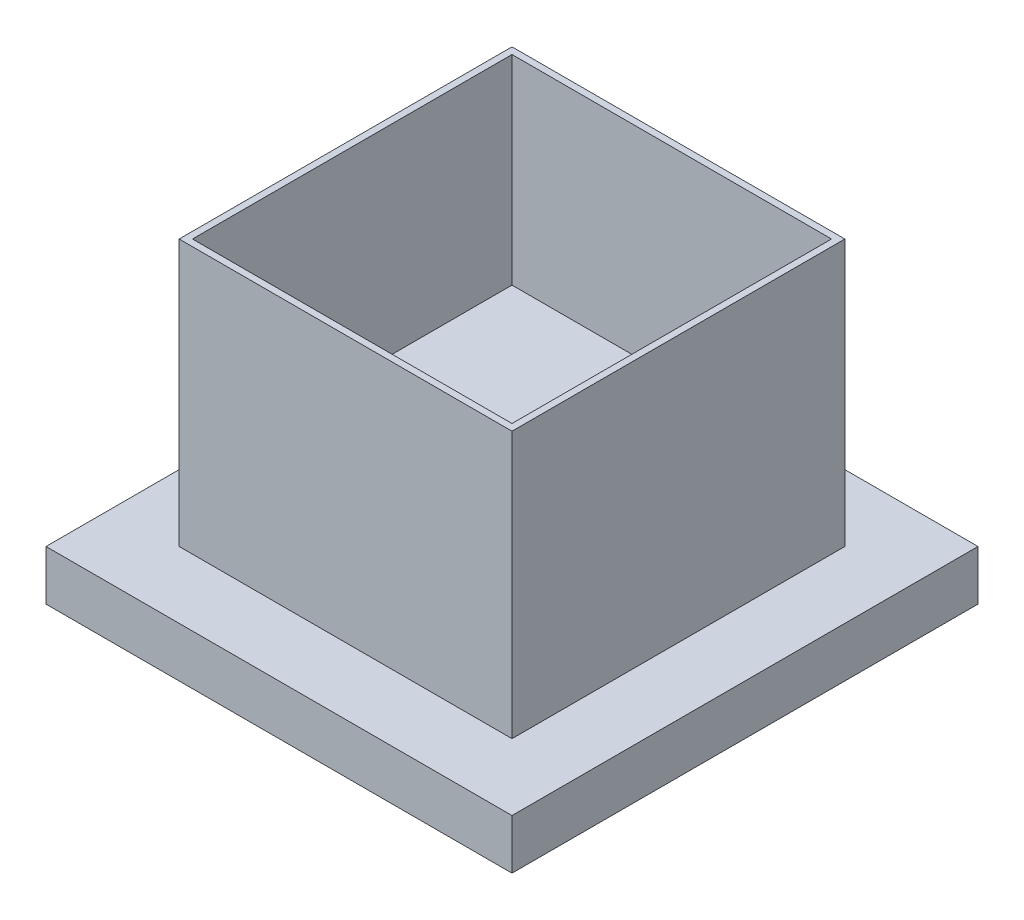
ISO-10303-21;
HEADER;
FILE_DESCRIPTION(('STEP AP214'),'2;1');
FILE_NAME('part.step','',(''),(''),'','','');
FILE_SCHEMA(('AUTOMOTIVE_DESIGN { 1 0 10303 214 1 1 1 1 }'));
ENDSEC;
DATA;
#1=APPLICATION_CONTEXT('core data for automotive mechanical design processes');
#2=APPLICATION_PROTOCOL_DEFINITION('international standard','automotive_design',2000,#1);
#3=PRODUCT_CONTEXT('',#1,'mechanical');
#4=PRODUCT('Part','Part','',(#3));
#5=PRODUCT_RELATED_PRODUCT_CATEGORY('part','',(#4));
#6=PRODUCT_DEFINITION_FORMATION('','',#4);
#7=PRODUCT_DEFINITION_CONTEXT('part definition',#1,'design');
#8=PRODUCT_DEFINITION('design','',#6,#7);
#9=PRODUCT_DEFINITION_SHAPE('','',#8);
#10=(LENGTH_UNIT() NAMED_UNIT(*) SI_UNIT(.MILLI.,.METRE.));
#11=(NAMED_UNIT(*) PLANE_ANGLE_UNIT() SI_UNIT($,.RADIAN.));
#12=(NAMED_UNIT(*) SI_UNIT($,.STERADIAN.) SOLID_ANGLE_UNIT());
#13=UNCERTAINTY_MEASURE_WITH_UNIT(LENGTH_MEASURE(1.E-05),#10,'distance_accuracy_value','');
#14=(GEOMETRIC_REPRESENTATION_CONTEXT(3) GLOBAL_UNCERTAINTY_ASSIGNED_CONTEXT((#13)) GLOBAL_UNIT_ASSIGNED_CONTEXT((#10,
#11,#12)) REPRESENTATION_CONTEXT('',''));
#15=CARTESIAN_POINT('',(0.,0.,0.));
#16=DIRECTION('',(0.,0.,1.));
#17=DIRECTION('',(1.,0.,0.));
#18=AXIS2_PLACEMENT_3D('',#15,#16,#17);
#19=CARTESIAN_POINT('',(0.,7.5,0.));
#20=DIRECTION('',(0.,-1.,0.));
#21=DIRECTION('',(0.,0.,-1.));
#22=AXIS2_PLACEMENT_3D('',#19,#20,#21);
#23=PLANE('',#22);
#24=DIRECTION('',(0.,0.,1.));
#25=VECTOR('',#24,1.);
#26=CARTESIAN_POINT('',(0.,7.5,0.));
#27=LINE('',#26,#25);
#28=CARTESIAN_POINT('',(0.,7.5,-70.));
#29=VERTEX_POINT('',#28);
#30=CARTESIAN_POINT('',(0.,7.5,0.));
#31=VERTEX_POINT('',#30);
#32=EDGE_CURVE('E288',#29,#31,#27,.T.);
#33=ORIENTED_EDGE('',*,*,#32,.T.);
#34=DIRECTION('',(1.,0.,0.));
#35=VECTOR('',#34,1.);
#36=CARTESIAN_POINT('',(0.,7.5,0.));
#37=LINE('',#36,#35);
#38=CARTESIAN_POINT('',(70.,7.5,0.));
#39=VERTEX_POINT('',#38);
#40=EDGE_CURVE('E388',#31,#39,#37,.T.);
#41=ORIENTED_EDGE('',*,*,#40,.T.);
#42=DIRECTION('',(0.,0.,-1.));
#43=VECTOR('',#42,1.);
#44=CARTESIAN_POINT('',(70.,7.5,0.));
#45=LINE('',#44,#43);
#46=CARTESIAN_POINT('',(70.,7.5,-70.));
#47=VERTEX_POINT('',#46);
#48=EDGE_CURVE('E279',#39,#47,#45,.T.);
#49=ORIENTED_EDGE('',*,*,#48,.T.);
#50=DIRECTION('',(-1.,0.,0.));
#51=VECTOR('',#50,1.);
#52=CARTESIAN_POINT('',(0.,7.5,-70.));
#53=LINE('',#52,#51);
#54=EDGE_CURVE('E296',#47,#29,#53,.T.);
#55=ORIENTED_EDGE('',*,*,#54,.T.);
#56=EDGE_LOOP('',(#33,#41,#49,#55));
#57=FACE_BOUND('',#56,.T.);
#58=DIRECTION('',(-1.,0.,0.));
#59=VECTOR('',#58,1.);
#60=CARTESIAN_POINT('',(60.,7.5,-60.));
#61=LINE('',#60,#59);
#62=CARTESIAN_POINT('',(60.,7.5,-60.));
#63=VERTEX_POINT('',#62);
#64=CARTESIAN_POINT('',(10.,7.5,-60.));
#65=VERTEX_POINT('',#64);
#66=EDGE_CURVE('E331',#63,#65,#61,.T.);
#67=ORIENTED_EDGE('',*,*,#66,.F.);
#68=DIRECTION('',(0.,0.,-1.));
#69=VECTOR('',#68,1.);
#70=CARTESIAN_POINT('',(60.,7.5,-10.));
#71=LINE('',#70,#69);
#72=CARTESIAN_POINT('',(60.,7.5,-10.));
#73=VERTEX_POINT('',#72);
#74=EDGE_CURVE('E346',#73,#63,#71,.T.);
#75=ORIENTED_EDGE('',*,*,#74,.F.);
#76=DIRECTION('',(1.,0.,0.));
#77=VECTOR('',#76,1.);
#78=CARTESIAN_POINT('',(10.,7.5,-10.));
#79=LINE('',#78,#77);
#80=CARTESIAN_POINT('',(10.,7.5,-10.));
#81=VERTEX_POINT('',#80);
#82=EDGE_CURVE('E363',#81,#73,#79,.T.);
#83=ORIENTED_EDGE('',*,*,#82,.F.);
#84=DIRECTION('',(0.,0.,1.));
#85=VECTOR('',#84,1.);
#86=CARTESIAN_POINT('',(10.,7.5,-60.));
#87=LINE('',#86,#85);
#88=EDGE_CURVE('E359',#65,#81,#87,.T.);
#89=ORIENTED_EDGE('',*,*,#88,.F.);
#90=EDGE_LOOP('',(#67,#75,#83,#89));
#91=FACE_BOUND('',#90,.T.);
#92=ADVANCED_FACE('F41',(#57,#91),#23,.F.);
#93=CARTESIAN_POINT('',(0.,7.5,0.));
#94=DIRECTION('',(1.,0.,0.));
#95=DIRECTION('',(0.,0.,-1.));
#96=AXIS2_PLACEMENT_3D('',#93,#94,#95);
#97=PLANE('',#96);
#98=DIRECTION('',(0.,0.,1.));
#99=VECTOR('',#98,1.);
#100=CARTESIAN_POINT('',(0.,0.,0.));
#101=LINE('',#100,#99);
#102=CARTESIAN_POINT('',(0.,0.,-70.));
#103=VERTEX_POINT('',#102);
#104=CARTESIAN_POINT('',(0.,0.,0.));
#105=VERTEX_POINT('',#104);
#106=EDGE_CURVE('E275',#103,#105,#101,.T.);
#107=ORIENTED_EDGE('',*,*,#106,.T.);
#108=DIRECTION('',(0.,-1.,0.));
#109=VECTOR('',#108,1.);
#110=CARTESIAN_POINT('',(0.,7.5,0.));
#111=LINE('',#110,#109);
#112=EDGE_CURVE('E269',#31,#105,#111,.T.);
#113=ORIENTED_EDGE('',*,*,#112,.F.);
#114=ORIENTED_EDGE('',*,*,#32,.F.);
#115=DIRECTION('',(0.,-1.,0.));
#116=VECTOR('',#115,1.);
#117=CARTESIAN_POINT('',(0.,7.5,-70.));
#118=LINE('',#117,#116);
#119=EDGE_CURVE('E292',#29,#103,#118,.T.);
#120=ORIENTED_EDGE('',*,*,#119,.T.);
#121=EDGE_LOOP('',(#107,#113,#114,#120));
#122=FACE_BOUND('',#121,.T.);
#123=ADVANCED_FACE('F43',(#122),#97,.F.);
#124=CARTESIAN_POINT('',(0.,7.5,0.));
#125=DIRECTION('',(0.,0.,-1.));
#126=DIRECTION('',(-1.,0.,0.));
#127=AXIS2_PLACEMENT_3D('',#124,#125,#126);
#128=PLANE('',#127);
#129=DIRECTION('',(1.,0.,0.));
#130=VECTOR('',#129,1.);
#131=CARTESIAN_POINT('',(0.,0.,0.));
#132=LINE('',#131,#130);
#133=CARTESIAN_POINT('',(70.,0.,0.));
#134=VERTEX_POINT('',#133);
#135=EDGE_CURVE('E264',#105,#134,#132,.T.);
#136=ORIENTED_EDGE('',*,*,#135,.T.);
#137=DIRECTION('',(0.,-1.,0.));
#138=VECTOR('',#137,1.);
#139=CARTESIAN_POINT('',(70.,7.5,0.));
#140=LINE('',#139,#138);
#141=EDGE_CURVE('E266',#39,#134,#140,.T.);
#142=ORIENTED_EDGE('',*,*,#141,.F.);
#143=ORIENTED_EDGE('',*,*,#40,.F.);
#144=ORIENTED_EDGE('',*,*,#112,.T.);
#145=EDGE_LOOP('',(#136,#142,#143,#144));
#146=FACE_BOUND('',#145,.T.);
#147=ADVANCED_FACE('F254',(#146),#128,.F.);
#148=CARTESIAN_POINT('',(70.,7.5,0.));
#149=DIRECTION('',(-1.,0.,0.));
#150=DIRECTION('',(0.,0.,1.));
#151=AXIS2_PLACEMENT_3D('',#148,#149,#150);
#152=PLANE('',#151);
#153=DIRECTION('',(0.,0.,-1.));
#154=VECTOR('',#153,1.);
#155=CARTESIAN_POINT('',(70.,0.,0.));
#156=LINE('',#155,#154);
#157=CARTESIAN_POINT('',(70.,0.,-70.));
#158=VERTEX_POINT('',#157);
#159=EDGE_CURVE('E274',#134,#158,#156,.T.);
#160=ORIENTED_EDGE('',*,*,#159,.T.);
#161=DIRECTION('',(0.,-1.,0.));
#162=VECTOR('',#161,1.);
#163=CARTESIAN_POINT('',(70.,7.5,-70.));
#164=LINE('',#163,#162);
#165=EDGE_CURVE('E281',#47,#158,#164,.T.);
#166=ORIENTED_EDGE('',*,*,#165,.F.);
#167=ORIENTED_EDGE('',*,*,#48,.F.);
#168=ORIENTED_EDGE('',*,*,#141,.T.);
#169=EDGE_LOOP('',(#160,#166,#167,#168));
#170=FACE_BOUND('',#169,.T.);
#171=ADVANCED_FACE('F251',(#170),#152,.F.);
#172=CARTESIAN_POINT('',(0.,7.5,-70.));
#173=DIRECTION('',(0.,0.,1.));
#174=DIRECTION('',(1.,0.,0.));
#175=AXIS2_PLACEMENT_3D('',#172,#173,#174);
#176=PLANE('',#175);
#177=DIRECTION('',(-1.,0.,0.));
#178=VECTOR('',#177,1.);
#179=CARTESIAN_POINT('',(0.,0.,-70.));
#180=LINE('',#179,#178);
#181=EDGE_CURVE('E284',#158,#103,#180,.T.);
#182=ORIENTED_EDGE('',*,*,#181,.T.);
#183=ORIENTED_EDGE('',*,*,#119,.F.);
#184=ORIENTED_EDGE('',*,*,#54,.F.);
#185=ORIENTED_EDGE('',*,*,#165,.T.);
#186=EDGE_LOOP('',(#182,#183,#184,#185));
#187=FACE_BOUND('',#186,.T.);
#188=ADVANCED_FACE('F248',(#187),#176,.F.);
#189=CARTESIAN_POINT('',(0.,0.,0.));
#190=DIRECTION('',(0.,-1.,0.));
#191=DIRECTION('',(0.,0.,-1.));
#192=AXIS2_PLACEMENT_3D('',#189,#190,#191);
#193=PLANE('',#192);
#194=CARTESIAN_POINT('',(45.,0.,-47.5));
#195=DIRECTION('',(0.,-1.,0.));
#196=DIRECTION('',(0.,0.,-1.));
#197=AXIS2_PLACEMENT_3D('',#194,#195,#196);
#198=CIRCLE('',#197,20.3125);
#199=CARTESIAN_POINT('',(33.5612201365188,0.,-64.2854690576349));
#200=VERTEX_POINT('',#199);
#201=CARTESIAN_POINT('',(26.1228271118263,0.,-40.));
#202=VERTEX_POINT('',#201);
#203=EDGE_CURVE('E50',#200,#202,#198,.F.);
#204=ORIENTED_EDGE('',*,*,#203,.T.);
#205=DIRECTION('',(1.,0.,0.));
#206=VECTOR('',#205,1.);
#207=CARTESIAN_POINT('',(0.,0.,-40.));
#208=LINE('',#207,#206);
#209=CARTESIAN_POINT('',(43.2521728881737,0.,-40.));
#210=VERTEX_POINT('',#209);
#211=EDGE_CURVE('E11',#202,#210,#208,.T.);
#212=ORIENTED_EDGE('',*,*,#211,.T.);
#213=CARTESIAN_POINT('',(24.375,0.,-47.5));
#214=DIRECTION('',(0.,-1.,0.));
#215=DIRECTION('',(0.,0.,-1.));
#216=AXIS2_PLACEMENT_3D('',#213,#214,#215);
#217=CIRCLE('',#216,20.3125);
#218=CARTESIAN_POINT('',(35.8137798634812,0.,-64.2854690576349));
#219=VERTEX_POINT('',#218);
#220=EDGE_CURVE('E153',#210,#219,#217,.F.);
#221=ORIENTED_EDGE('',*,*,#220,.T.);
#222=CARTESIAN_POINT('',(34.6875,0.,-62.6327459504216));
#223=DIRECTION('',(0.,-1.,0.));
#224=DIRECTION('',(0.,0.,-1.));
#225=AXIS2_PLACEMENT_3D('',#222,#223,#224);
#226=CIRCLE('',#225,2.);
#227=EDGE_CURVE('E149',#219,#200,#226,.F.);
#228=ORIENTED_EDGE('',*,*,#227,.T.);
#229=EDGE_LOOP('',(#204,#212,#221,#228));
#230=FACE_BOUND('',#229,.T.);
#231=ORIENTED_EDGE('',*,*,#181,.F.);
#232=ORIENTED_EDGE('',*,*,#159,.F.);
#233=ORIENTED_EDGE('',*,*,#135,.F.);
#234=ORIENTED_EDGE('',*,*,#106,.F.);
#235=EDGE_LOOP('',(#231,#232,#233,#234));
#236=FACE_BOUND('',#235,.T.);
#237=ADVANCED_FACE('F146',(#230,#236),#193,.T.);
#238=CARTESIAN_POINT('',(60.,47.5,-60.));
#239=DIRECTION('',(0.,0.,1.));
#240=DIRECTION('',(1.,0.,0.));
#241=AXIS2_PLACEMENT_3D('',#238,#239,#240);
#242=PLANE('',#241);
#243=ORIENTED_EDGE('',*,*,#66,.T.);
#244=DIRECTION('',(0.,-1.,0.));
#245=VECTOR('',#244,1.);
#246=CARTESIAN_POINT('',(10.,47.5,-60.));
#247=LINE('',#246,#245);
#248=CARTESIAN_POINT('',(10.,47.5,-60.));
#249=VERTEX_POINT('',#248);
#250=EDGE_CURVE('E381',#249,#65,#247,.T.);
#251=ORIENTED_EDGE('',*,*,#250,.F.);
#252=DIRECTION('',(-1.,0.,0.));
#253=VECTOR('',#252,1.);
#254=CARTESIAN_POINT('',(60.,47.5,-60.));
#255=LINE('',#254,#253);
#256=CARTESIAN_POINT('',(60.,47.5,-60.));
#257=VERTEX_POINT('',#256);
#258=EDGE_CURVE('E341',#257,#249,#255,.T.);
#259=ORIENTED_EDGE('',*,*,#258,.F.);
#260=DIRECTION('',(0.,-1.,0.));
#261=VECTOR('',#260,1.);
#262=CARTESIAN_POINT('',(60.,47.5,-60.));
#263=LINE('',#262,#261);
#264=EDGE_CURVE('E355',#257,#63,#263,.T.);
#265=ORIENTED_EDGE('',*,*,#264,.T.);
#266=EDGE_LOOP('',(#243,#251,#259,#265));
#267=FACE_BOUND('',#266,.T.);
#268=ADVANCED_FACE('F238',(#267),#242,.F.);
#269=CARTESIAN_POINT('',(10.,47.5,-60.));
#270=DIRECTION('',(1.,0.,0.));
#271=DIRECTION('',(0.,0.,-1.));
#272=AXIS2_PLACEMENT_3D('',#269,#270,#271);
#273=PLANE('',#272);
#274=ORIENTED_EDGE('',*,*,#88,.T.);
#275=DIRECTION('',(0.,-1.,0.));
#276=VECTOR('',#275,1.);
#277=CARTESIAN_POINT('',(10.,47.5,-10.));
#278=LINE('',#277,#276);
#279=CARTESIAN_POINT('',(10.,47.5,-10.));
#280=VERTEX_POINT('',#279);
#281=EDGE_CURVE('E377',#280,#81,#278,.T.);
#282=ORIENTED_EDGE('',*,*,#281,.F.);
#283=DIRECTION('',(0.,0.,1.));
#284=VECTOR('',#283,1.);
#285=CARTESIAN_POINT('',(10.,47.5,-60.));
#286=LINE('',#285,#284);
#287=EDGE_CURVE('E345',#249,#280,#286,.T.);
#288=ORIENTED_EDGE('',*,*,#287,.F.);
#289=ORIENTED_EDGE('',*,*,#250,.T.);
#290=EDGE_LOOP('',(#274,#282,#288,#289));
#291=FACE_BOUND('',#290,.T.);
#292=ADVANCED_FACE('F234',(#291),#273,.F.);
#293=CARTESIAN_POINT('',(10.,47.5,-10.));
#294=DIRECTION('',(0.,0.,-1.));
#295=DIRECTION('',(-1.,0.,0.));
#296=AXIS2_PLACEMENT_3D('',#293,#294,#295);
#297=PLANE('',#296);
#298=ORIENTED_EDGE('',*,*,#82,.T.);
#299=DIRECTION('',(0.,-1.,0.));
#300=VECTOR('',#299,1.);
#301=CARTESIAN_POINT('',(60.,47.5,-10.));
#302=LINE('',#301,#300);
#303=CARTESIAN_POINT('',(60.,47.5,-10.));
#304=VERTEX_POINT('',#303);
#305=EDGE_CURVE('E373',#304,#73,#302,.T.);
#306=ORIENTED_EDGE('',*,*,#305,.F.);
#307=DIRECTION('',(1.,0.,0.));
#308=VECTOR('',#307,1.);
#309=CARTESIAN_POINT('',(10.,47.5,-10.));
#310=LINE('',#309,#308);
#311=EDGE_CURVE('E349',#280,#304,#310,.T.);
#312=ORIENTED_EDGE('',*,*,#311,.F.);
#313=ORIENTED_EDGE('',*,*,#281,.T.);
#314=EDGE_LOOP('',(#298,#306,#312,#313));
#315=FACE_BOUND('',#314,.T.);
#316=ADVANCED_FACE('F230',(#315),#297,.F.);
#317=CARTESIAN_POINT('',(60.,47.5,-10.));
#318=DIRECTION('',(-1.,0.,0.));
#319=DIRECTION('',(0.,0.,1.));
#320=AXIS2_PLACEMENT_3D('',#317,#318,#319);
#321=PLANE('',#320);
#322=ORIENTED_EDGE('',*,*,#74,.T.);
#323=ORIENTED_EDGE('',*,*,#264,.F.);
#324=DIRECTION('',(0.,0.,-1.));
#325=VECTOR('',#324,1.);
#326=CARTESIAN_POINT('',(60.,47.5,-10.));
#327=LINE('',#326,#325);
#328=EDGE_CURVE('E352',#304,#257,#327,.T.);
#329=ORIENTED_EDGE('',*,*,#328,.F.);
#330=ORIENTED_EDGE('',*,*,#305,.T.);
#331=EDGE_LOOP('',(#322,#323,#329,#330));
#332=FACE_BOUND('',#331,.T.);
#333=ADVANCED_FACE('F226',(#332),#321,.F.);
#334=CARTESIAN_POINT('',(0.,47.5,0.));
#335=DIRECTION('',(0.,1.,0.));
#336=DIRECTION('',(0.,0.,1.));
#337=AXIS2_PLACEMENT_3D('',#334,#335,#336);
#338=PLANE('',#337);
#339=DIRECTION('',(0.,0.,-1.));
#340=VECTOR('',#339,1.);
#341=CARTESIAN_POINT('',(59.,47.5,-11.));
#342=LINE('',#341,#340);
#343=CARTESIAN_POINT('',(59.,47.5,-11.));
#344=VERTEX_POINT('',#343);
#345=CARTESIAN_POINT('',(59.,47.5,-59.));
#346=VERTEX_POINT('',#345);
#347=EDGE_CURVE('E305',#344,#346,#342,.T.);
#348=ORIENTED_EDGE('',*,*,#347,.F.);
#349=DIRECTION('',(1.,0.,0.));
#350=VECTOR('',#349,1.);
#351=CARTESIAN_POINT('',(11.,47.5,-11.));
#352=LINE('',#351,#350);
#353=CARTESIAN_POINT('',(11.,47.5,-11.));
#354=VERTEX_POINT('',#353);
#355=EDGE_CURVE('E323',#354,#344,#352,.T.);
#356=ORIENTED_EDGE('',*,*,#355,.F.);
#357=DIRECTION('',(0.,0.,1.));
#358=VECTOR('',#357,1.);
#359=CARTESIAN_POINT('',(11.,47.5,-59.));
#360=LINE('',#359,#358);
#361=CARTESIAN_POINT('',(11.,47.5,-59.));
#362=VERTEX_POINT('',#361);
#363=EDGE_CURVE('E314',#362,#354,#360,.T.);
#364=ORIENTED_EDGE('',*,*,#363,.F.);
#365=DIRECTION('',(-1.,0.,0.));
#366=VECTOR('',#365,1.);
#367=CARTESIAN_POINT('',(59.,47.5,-59.));
#368=LINE('',#367,#366);
#369=EDGE_CURVE('E308',#346,#362,#368,.T.);
#370=ORIENTED_EDGE('',*,*,#369,.F.);
#371=EDGE_LOOP('',(#348,#356,#364,#370));
#372=FACE_BOUND('',#371,.T.);
#373=ORIENTED_EDGE('',*,*,#258,.T.);
#374=ORIENTED_EDGE('',*,*,#287,.T.);
#375=ORIENTED_EDGE('',*,*,#311,.T.);
#376=ORIENTED_EDGE('',*,*,#328,.T.);
#377=EDGE_LOOP('',(#373,#374,#375,#376));
#378=FACE_BOUND('',#377,.T.);
#379=ADVANCED_FACE('F222',(#372,#378),#338,.T.);
#380=CARTESIAN_POINT('',(59.,17.5,-11.));
#381=DIRECTION('',(1.,0.,0.));
#382=DIRECTION('',(0.,0.,-1.));
#383=AXIS2_PLACEMENT_3D('',#380,#381,#382);
#384=PLANE('',#383);
#385=ORIENTED_EDGE('',*,*,#347,.T.);
#386=DIRECTION('',(0.,1.,0.));
#387=VECTOR('',#386,1.);
#388=CARTESIAN_POINT('',(59.,17.5,-59.));
#389=LINE('',#388,#387);
#390=CARTESIAN_POINT('',(59.,17.5,-59.));
#391=VERTEX_POINT('',#390);
#392=EDGE_CURVE('E338',#391,#346,#389,.T.);
#393=ORIENTED_EDGE('',*,*,#392,.F.);
#394=DIRECTION('',(0.,0.,-1.));
#395=VECTOR('',#394,1.);
#396=CARTESIAN_POINT('',(59.,17.5,-11.));
#397=LINE('',#396,#395);
#398=CARTESIAN_POINT('',(59.,17.5,-11.));
#399=VERTEX_POINT('',#398);
#400=EDGE_CURVE('E327',#399,#391,#397,.T.);
#401=ORIENTED_EDGE('',*,*,#400,.F.);
#402=DIRECTION('',(0.,1.,0.));
#403=VECTOR('',#402,1.);
#404=CARTESIAN_POINT('',(59.,17.5,-11.));
#405=LINE('',#404,#403);
#406=EDGE_CURVE('E328',#399,#344,#405,.T.);
#407=ORIENTED_EDGE('',*,*,#406,.T.);
#408=EDGE_LOOP('',(#385,#393,#401,#407));
#409=FACE_BOUND('',#408,.T.);
#410=ADVANCED_FACE('F212',(#409),#384,.F.);
#411=CARTESIAN_POINT('',(11.,17.5,-11.));
#412=DIRECTION('',(0.,0.,1.));
#413=DIRECTION('',(1.,0.,0.));
#414=AXIS2_PLACEMENT_3D('',#411,#412,#413);
#415=PLANE('',#414);
#416=ORIENTED_EDGE('',*,*,#355,.T.);
#417=ORIENTED_EDGE('',*,*,#406,.F.);
#418=DIRECTION('',(1.,0.,0.));
#419=VECTOR('',#418,1.);
#420=CARTESIAN_POINT('',(11.,17.5,-11.));
#421=LINE('',#420,#419);
#422=CARTESIAN_POINT('',(11.,17.5,-11.));
#423=VERTEX_POINT('',#422);
#424=EDGE_CURVE('E317',#423,#399,#421,.T.);
#425=ORIENTED_EDGE('',*,*,#424,.F.);
#426=DIRECTION('',(0.,1.,0.));
#427=VECTOR('',#426,1.);
#428=CARTESIAN_POINT('',(11.,17.5,-11.));
#429=LINE('',#428,#427);
#430=EDGE_CURVE('E332',#423,#354,#429,.T.);
#431=ORIENTED_EDGE('',*,*,#430,.T.);
#432=EDGE_LOOP('',(#416,#417,#425,#431));
#433=FACE_BOUND('',#432,.T.);
#434=ADVANCED_FACE('F208',(#433),#415,.F.);
#435=CARTESIAN_POINT('',(11.,17.5,-59.));
#436=DIRECTION('',(-1.,0.,0.));
#437=DIRECTION('',(0.,0.,1.));
#438=AXIS2_PLACEMENT_3D('',#435,#436,#437);
#439=PLANE('',#438);
#440=ORIENTED_EDGE('',*,*,#363,.T.);
#441=ORIENTED_EDGE('',*,*,#430,.F.);
#442=DIRECTION('',(0.,0.,1.));
#443=VECTOR('',#442,1.);
#444=CARTESIAN_POINT('',(11.,17.5,-59.));
#445=LINE('',#444,#443);
#446=CARTESIAN_POINT('',(11.,17.5,-59.));
#447=VERTEX_POINT('',#446);
#448=EDGE_CURVE('E410',#447,#423,#445,.T.);
#449=ORIENTED_EDGE('',*,*,#448,.F.);
#450=DIRECTION('',(0.,1.,0.));
#451=VECTOR('',#450,1.);
#452=CARTESIAN_POINT('',(11.,17.5,-59.));
#453=LINE('',#452,#451);
#454=EDGE_CURVE('E335',#447,#362,#453,.T.);
#455=ORIENTED_EDGE('',*,*,#454,.T.);
#456=EDGE_LOOP('',(#440,#441,#449,#455));
#457=FACE_BOUND('',#456,.T.);
#458=ADVANCED_FACE('F211',(#457),#439,.F.);
#459=CARTESIAN_POINT('',(59.,17.5,-59.));
#460=DIRECTION('',(0.,0.,-1.));
#461=DIRECTION('',(-1.,0.,0.));
#462=AXIS2_PLACEMENT_3D('',#459,#460,#461);
#463=PLANE('',#462);
#464=ORIENTED_EDGE('',*,*,#369,.T.);
#465=ORIENTED_EDGE('',*,*,#454,.F.);
#466=DIRECTION('',(-1.,0.,0.));
#467=VECTOR('',#466,1.);
#468=CARTESIAN_POINT('',(59.,17.5,-59.));
#469=LINE('',#468,#467);
#470=EDGE_CURVE('E413',#391,#447,#469,.T.);
#471=ORIENTED_EDGE('',*,*,#470,.F.);
#472=ORIENTED_EDGE('',*,*,#392,.T.);
#473=EDGE_LOOP('',(#464,#465,#471,#472));
#474=FACE_BOUND('',#473,.T.);
#475=ADVANCED_FACE('F206',(#474),#463,.F.);
#476=CARTESIAN_POINT('',(0.,17.5,0.));
#477=DIRECTION('',(0.,1.,0.));
#478=DIRECTION('',(0.,0.,1.));
#479=AXIS2_PLACEMENT_3D('',#476,#477,#478);
#480=PLANE('',#479);
#481=ORIENTED_EDGE('',*,*,#400,.T.);
#482=ORIENTED_EDGE('',*,*,#470,.T.);
#483=ORIENTED_EDGE('',*,*,#448,.T.);
#484=ORIENTED_EDGE('',*,*,#424,.T.);
#485=EDGE_LOOP('',(#481,#482,#483,#484));
#486=FACE_BOUND('',#485,.T.);
#487=ADVANCED_FACE('F203',(#486),#480,.T.);
#488=CARTESIAN_POINT('',(34.6875,0.,-47.5));
#489=DIRECTION('',(0.,0.,-1.));
#490=DIRECTION('',(-1.,0.,0.));
#491=AXIS2_PLACEMENT_3D('',#488,#489,#490);
#492=DEGENERATE_TOROIDAL_SURFACE('',#491,10.3125,20.3125,.F.);
#493=CARTESIAN_POINT('',(43.2521270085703,-0.000200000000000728,-39.9998845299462));
#494=CARTESIAN_POINT('',(43.3037015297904,0.22456582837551,-40.1296531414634));
#495=CARTESIAN_POINT('',(43.3452525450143,0.451052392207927,-40.2604152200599));
#496=CARTESIAN_POINT('',(43.4081529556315,0.906108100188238,-40.5231417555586));
#497=CARTESIAN_POINT('',(43.4295034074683,1.13467713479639,-40.655106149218));
#498=CARTESIAN_POINT('',(43.4518701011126,1.592902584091,-40.9196627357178));
#499=CARTESIAN_POINT('',(43.4528561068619,1.82256010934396,-41.052255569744));
#500=CARTESIAN_POINT('',(43.4343425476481,2.28126646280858,-41.3170898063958));
#501=CARTESIAN_POINT('',(43.4148417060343,2.51031525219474,-41.4493311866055));
#502=CARTESIAN_POINT('',(43.3525580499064,2.98771788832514,-41.7249597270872));
#503=CARTESIAN_POINT('',(43.3077718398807,3.235877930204,-41.8682349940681));
#504=CARTESIAN_POINT('',(43.1937564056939,3.72805125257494,-42.1523913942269));
#505=CARTESIAN_POINT('',(43.1245177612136,3.97206289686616,-42.2932715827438));
#506=CARTESIAN_POINT('',(42.9618582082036,4.45382993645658,-42.571419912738));
#507=CARTESIAN_POINT('',(42.8684505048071,4.69158867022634,-42.7086899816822));
#508=CARTESIAN_POINT('',(42.6577969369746,5.15904558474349,-42.9785763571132));
#509=CARTESIAN_POINT('',(42.5405525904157,5.38874427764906,-43.1111929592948));
#510=CARTESIAN_POINT('',(42.2865179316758,5.83155620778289,-43.3668505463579));
#511=CARTESIAN_POINT('',(42.1503982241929,6.04495787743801,-43.4900580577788));
#512=CARTESIAN_POINT('',(41.8569054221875,6.46039752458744,-43.7299122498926));
#513=CARTESIAN_POINT('',(41.699541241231,6.66244021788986,-43.8465616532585));
#514=CARTESIAN_POINT('',(41.3643113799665,7.05347353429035,-44.0723248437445));
#515=CARTESIAN_POINT('',(41.1864378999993,7.24245914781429,-44.1814357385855));
#516=CARTESIAN_POINT('',(40.8113332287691,7.60542062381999,-44.3909916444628));
#517=CARTESIAN_POINT('',(40.6141039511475,7.77939796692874,-44.4914375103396));
#518=CARTESIAN_POINT('',(40.2149219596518,8.09984512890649,-44.6764477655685));
#519=CARTESIAN_POINT('',(40.0140925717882,8.24736508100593,-44.7616184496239));
#520=CARTESIAN_POINT('',(39.5979794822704,8.52621401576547,-44.9226119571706));
#521=CARTESIAN_POINT('',(39.3826973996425,8.65754480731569,-44.998435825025));
#522=CARTESIAN_POINT('',(38.9395842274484,8.90243790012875,-45.1398249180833));
#523=CARTESIAN_POINT('',(38.7117759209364,9.01603110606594,-45.2054079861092));
#524=CARTESIAN_POINT('',(38.245097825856,9.22442625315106,-45.3257249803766));
#525=CARTESIAN_POINT('',(38.0062342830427,9.31923864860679,-45.3804649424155));
#526=CARTESIAN_POINT('',(37.583162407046,9.46677360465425,-45.4656442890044));
#527=CARTESIAN_POINT('',(37.4010371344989,9.52401473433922,-45.4986924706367));
#528=CARTESIAN_POINT('',(37.0328740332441,9.6272798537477,-45.5583126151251));
#529=CARTESIAN_POINT('',(36.8468419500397,9.67331921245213,-45.5848934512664));
#530=CARTESIAN_POINT('',(36.6591374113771,9.71363057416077,-45.6081672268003));
#531=B_SPLINE_CURVE_WITH_KNOTS('',3,(#493,#494,#495,#496,#497,#498,#499,#500,#501,#502,#503,
#504,#505,#506,#507,#508,#509,#510,#511,#512,#513,#514,#515,#516,#517,#518,#519,#520,#521,#522,
#523,#524,#525,#526,#527,#528,#529,#530),.UNSPECIFIED.,.F.,.F.,(4,2,2,2,2,2,2,2,2,2,2,2,2,2,2,2,
2,2,4),(0.,0.793633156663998,1.58722480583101,2.38199465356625,3.17681403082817,
4.04582809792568,4.91517731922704,5.78405255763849,6.65287248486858,7.49632631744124,
8.33942735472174,9.18285008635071,10.0261895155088,10.8151855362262,11.6040933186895,
12.3916108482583,13.1786887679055,13.7594833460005,14.3394765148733),.UNSPECIFIED.);
#532=CARTESIAN_POINT('',(36.6600682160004,9.71343057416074,-45.6080517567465));
#533=VERTEX_POINT('',#532);
#534=EDGE_CURVE('E57',#210,#533,#531,.T.);
#535=ORIENTED_EDGE('',*,*,#534,.T.);
#536=CARTESIAN_POINT('',(36.6607307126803,9.71331510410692,-45.6082517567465));
#537=CARTESIAN_POINT('',(36.4994555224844,9.74144907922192,-45.5595222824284));
#538=CARTESIAN_POINT('',(36.335824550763,9.76625105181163,-45.5165640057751));
#539=CARTESIAN_POINT('',(36.0049380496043,9.80890252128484,-45.44268949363));
#540=CARTESIAN_POINT('',(35.8376816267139,9.82675028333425,-45.4117762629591));
#541=CARTESIAN_POINT('',(35.5054362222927,9.85479187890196,-45.3632067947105));
#542=CARTESIAN_POINT('',(35.340515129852,9.86518626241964,-45.3452031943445));
#543=CARTESIAN_POINT('',(35.009534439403,9.87896636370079,-45.3213353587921));
#544=CARTESIAN_POINT('',(34.8434750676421,9.88235343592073,-45.3154687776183));
#545=CARTESIAN_POINT('',(34.5130112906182,9.88206986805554,-45.3159599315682));
#546=CARTESIAN_POINT('',(34.3486066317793,9.87846814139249,-45.3221983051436));
#547=CARTESIAN_POINT('',(34.0209502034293,9.86439915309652,-45.3465665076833));
#548=CARTESIAN_POINT('',(33.8576986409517,9.85393068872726,-45.3646984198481));
#549=CARTESIAN_POINT('',(33.5288631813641,9.82588333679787,-45.4132778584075));
#550=CARTESIAN_POINT('',(33.3633458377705,9.80810990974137,-45.444062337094));
#551=CARTESIAN_POINT('',(33.0358735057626,9.76574977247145,-45.5174322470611));
#552=CARTESIAN_POINT('',(32.8739176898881,9.74116466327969,-45.5600149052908));
#553=CARTESIAN_POINT('',(32.7142692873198,9.71331510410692,-45.6082517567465));
#554=B_SPLINE_CURVE_WITH_KNOTS('',3,(#536,#537,#538,#539,#540,#541,#542,#543,#544,#545,#546,
#547,#548,#549,#550,#551,#552,#553),.UNSPECIFIED.,.F.,.F.,(4,2,2,2,2,2,2,2,4),(0.,
0.512327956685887,1.02478363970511,1.52287264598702,2.02086536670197,2.51397254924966,
3.00716612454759,3.51444566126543,4.02160606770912),.UNSPECIFIED.);
#555=CARTESIAN_POINT('',(32.7149317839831,9.71343057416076,-45.6080517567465));
#556=VERTEX_POINT('',#555);
#557=EDGE_CURVE('E161',#533,#556,#554,.T.);
#558=ORIENTED_EDGE('',*,*,#557,.T.);
#559=CARTESIAN_POINT('',(32.7158625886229,9.71363057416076,-45.6081672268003));
#560=CARTESIAN_POINT('',(32.4809038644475,9.66319053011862,-45.5790456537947));
#561=CARTESIAN_POINT('',(32.2485520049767,9.60374201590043,-45.5447230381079));
#562=CARTESIAN_POINT('',(31.7907686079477,9.46759270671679,-45.4661171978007));
#563=CARTESIAN_POINT('',(31.5653348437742,9.39089753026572,-45.4218372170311));
#564=CARTESIAN_POINT('',(31.1236406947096,9.2212551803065,-45.3238941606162));
#565=CARTESIAN_POINT('',(30.9073534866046,9.12836031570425,-45.2702612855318));
#566=CARTESIAN_POINT('',(30.4846275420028,8.92705044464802,-45.1540349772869));
#567=CARTESIAN_POINT('',(30.2781893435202,8.81863459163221,-45.0914410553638));
#568=CARTESIAN_POINT('',(29.8766948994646,8.58740527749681,-44.9579407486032));
#569=CARTESIAN_POINT('',(29.6816265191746,8.46460760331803,-44.8870434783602));
#570=CARTESIAN_POINT('',(29.3037008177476,8.20554047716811,-44.7374710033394));
#571=CARTESIAN_POINT('',(29.120848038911,8.06926606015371,-44.6587929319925));
#572=CARTESIAN_POINT('',(28.7683968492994,7.78438168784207,-44.4943148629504));
#573=CARTESIAN_POINT('',(28.5988005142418,7.63576980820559,-44.4085137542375));
#574=CARTESIAN_POINT('',(28.2736802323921,7.32732657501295,-44.230433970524));
#575=CARTESIAN_POINT('',(28.1181616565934,7.16749098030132,-44.1381528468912));
#576=CARTESIAN_POINT('',(27.8157627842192,6.83089971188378,-43.9438217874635));
#577=CARTESIAN_POINT('',(27.66951840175,6.6537155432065,-43.8415244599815));
#578=CARTESIAN_POINT('',(27.393768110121,6.28975275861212,-43.6313904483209));
#579=CARTESIAN_POINT('',(27.2642683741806,6.1029706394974,-43.5235517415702));
#580=CARTESIAN_POINT('',(27.0226053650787,5.72120608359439,-43.3031398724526));
#581=CARTESIAN_POINT('',(26.9104404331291,5.52622443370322,-43.1905671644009));
#582=CARTESIAN_POINT('',(26.7038033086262,5.1292770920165,-42.9613895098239));
#583=CARTESIAN_POINT('',(26.6093376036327,4.92730887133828,-42.8447831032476));
#584=CARTESIAN_POINT('',(26.4324500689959,4.50334345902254,-42.60000655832));
#585=CARTESIAN_POINT('',(26.3513391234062,4.2809354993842,-42.4715992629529));
#586=CARTESIAN_POINT('',(26.210040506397,3.83118751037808,-42.2119371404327));
#587=CARTESIAN_POINT('',(26.1498541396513,3.60384717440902,-42.0806821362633));
#588=CARTESIAN_POINT('',(26.0505657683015,3.14575088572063,-41.8162001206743));
#589=CARTESIAN_POINT('',(26.0114622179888,2.9149951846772,-41.6829732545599));
#590=CARTESIAN_POINT('',(25.9543946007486,2.45160865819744,-41.4154369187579));
#591=CARTESIAN_POINT('',(25.9364271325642,2.2189781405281,-41.2811276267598));
#592=CARTESIAN_POINT('',(25.9184383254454,1.65298165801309,-40.9543494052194));
#593=CARTESIAN_POINT('',(25.9294462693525,1.31928388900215,-40.7616889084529));
#594=CARTESIAN_POINT('',(25.9780757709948,0.821581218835,-40.4743401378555));
#595=CARTESIAN_POINT('',(25.9996134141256,0.656263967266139,-40.3788941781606));
#596=CARTESIAN_POINT('',(26.0533016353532,0.326943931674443,-40.1887611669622));
#597=CARTESIAN_POINT('',(26.0854511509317,0.162941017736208,-40.094074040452));
#598=CARTESIAN_POINT('',(26.1228729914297,-0.000199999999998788,-39.9998845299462));
#599=B_SPLINE_CURVE_WITH_KNOTS('',3,(#559,#560,#561,#562,#563,#564,#565,#566,#567,#568,#569,
#570,#571,#572,#573,#574,#575,#576,#577,#578,#579,#580,#581,#582,#583,#584,#585,#586,#587,#588,
#589,#590,#591,#592,#593,#594,#595,#596,#597,#598),.UNSPECIFIED.,.F.,.F.,(4,2,2,2,2,2,2,2,2,2,2,
2,2,2,2,2,2,2,2,4),(0.,0.725935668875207,1.45163518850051,2.17503340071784,2.89847108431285,
3.62112196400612,4.34404007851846,5.06707116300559,5.79037694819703,6.54402061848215,
7.29794134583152,8.05178988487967,8.80591420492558,9.61297427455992,10.4200846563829,
11.2271358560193,12.0340571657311,13.1877193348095,13.7637802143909,14.3397834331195),.UNSPECIFIED.);
#600=EDGE_CURVE('E158',#556,#202,#599,.T.);
#601=ORIENTED_EDGE('',*,*,#600,.T.);
#602=ORIENTED_EDGE('',*,*,#203,.F.);
#603=CARTESIAN_POINT('',(34.6875,0.,-64.2854690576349));
#604=DIRECTION('',(0.,0.,-1.));
#605=DIRECTION('',(-1.,0.,0.));
#606=AXIS2_PLACEMENT_3D('',#603,#604,#605);
#607=CIRCLE('',#606,1.12627986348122);
#608=EDGE_CURVE('E178',#200,#219,#607,.T.);
#609=ORIENTED_EDGE('',*,*,#608,.T.);
#610=ORIENTED_EDGE('',*,*,#220,.F.);
#611=EDGE_LOOP('',(#535,#558,#601,#602,#609,#610));
#612=FACE_BOUND('',#611,.T.);
#613=ADVANCED_FACE('F160',(#612),#492,.T.);
#614=CARTESIAN_POINT('',(34.6875,0.,-62.6327459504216));
#615=DIRECTION('',(0.,0.,-1.));
#616=DIRECTION('',(-1.,0.,0.));
#617=AXIS2_PLACEMENT_3D('',#614,#615,#616);
#618=SPHERICAL_SURFACE('',#617,2.);
#619=ORIENTED_EDGE('',*,*,#608,.F.);
#620=ORIENTED_EDGE('',*,*,#227,.F.);
#621=EDGE_LOOP('',(#619,#620));
#622=FACE_BOUND('',#621,.T.);
#623=ADVANCED_FACE('F196',(#622),#618,.F.);
#624=CARTESIAN_POINT('',(21.9928749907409,34.5798116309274,-2.53821636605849));
#625=DIRECTION('',(0.,0.866025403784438,-0.500000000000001));
#626=DIRECTION('',(0.,0.500000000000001,0.866025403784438));
#627=AXIS2_PLACEMENT_3D('',#624,#625,#626);
#628=PLANE('',#627);
#629=ORIENTED_EDGE('',*,*,#557,.F.);
#630=DIRECTION('',(1.,0.,0.));
#631=VECTOR('',#630,1.);
#632=CARTESIAN_POINT('',(21.9928749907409,9.71343057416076,-45.6080517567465));
#633=LINE('',#632,#631);
#634=EDGE_CURVE('E191',#556,#533,#633,.T.);
#635=ORIENTED_EDGE('',*,*,#634,.F.);
#636=EDGE_LOOP('',(#629,#635));
#637=FACE_BOUND('',#636,.T.);
#638=ADVANCED_FACE('F192',(#637),#628,.T.);
#639=CARTESIAN_POINT('',(0.,-17.3205080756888,-30.));
#640=DIRECTION('',(0.,-0.500000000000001,-0.866025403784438));
#641=DIRECTION('',(0.,0.866025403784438,-0.500000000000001));
#642=AXIS2_PLACEMENT_3D('',#639,#640,#641);
#643=PLANE('',#642);
#644=ORIENTED_EDGE('',*,*,#211,.F.);
#645=ORIENTED_EDGE('',*,*,#600,.F.);
#646=ORIENTED_EDGE('',*,*,#634,.T.);
#647=ORIENTED_EDGE('',*,*,#534,.F.);
#648=EDGE_LOOP('',(#644,#645,#646,#647));
#649=FACE_BOUND('',#648,.T.);
#650=ADVANCED_FACE('F156',(#649),#643,.T.);
#651=CLOSED_SHELL('',(#92,#123,#147,#171,#188,#237,#268,#292,#316,#333,#379,#410,#434,#458,#475,
#487,#613,#623,#638,#650));
#652=MANIFOLD_SOLID_BREP('B2',#651);
#653=ADVANCED_BREP_SHAPE_REPRESENTATION('',(#18,#652),#14);
#654=SHAPE_DEFINITION_REPRESENTATION(#9,#653);
ENDSEC;
END-ISO-10303-21;
